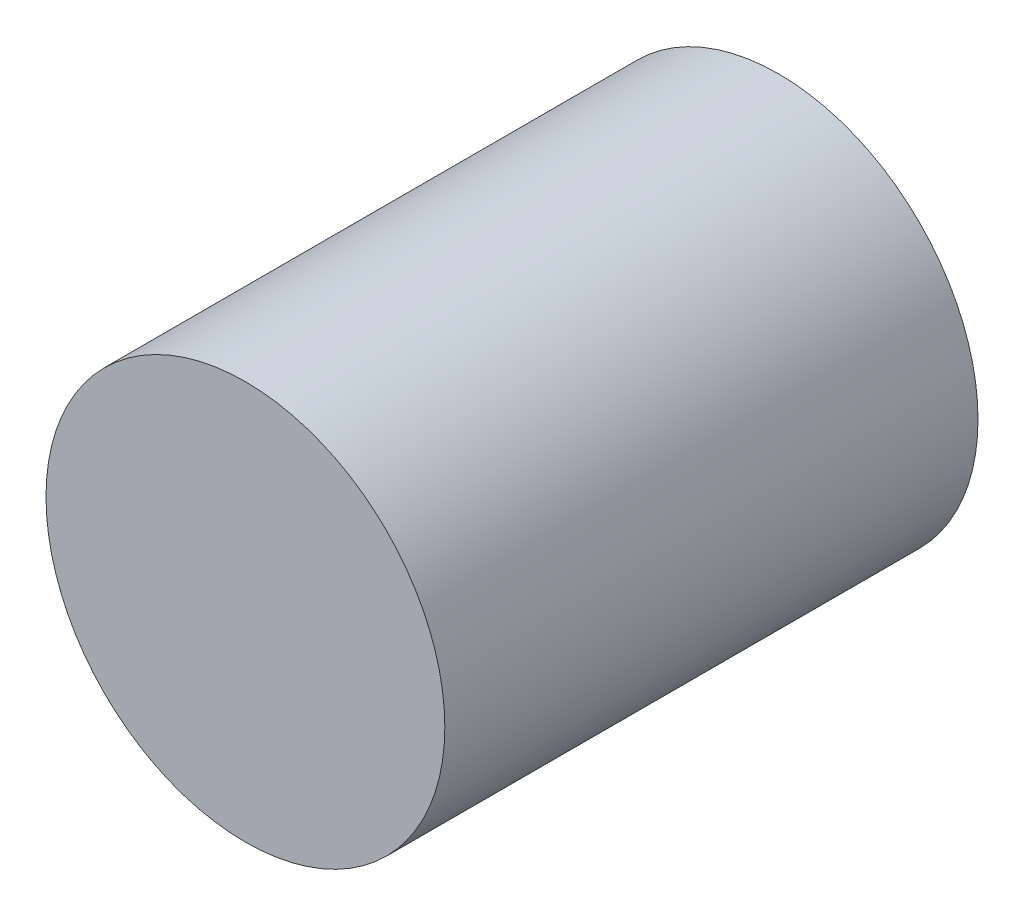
ISO-10303-21;
HEADER;
FILE_DESCRIPTION(('STEP AP214'),'2;1');
FILE_NAME('part.step','',(''),(''),'','','');
FILE_SCHEMA(('AUTOMOTIVE_DESIGN { 1 0 10303 214 1 1 1 1 }'));
ENDSEC;
DATA;
#1=APPLICATION_CONTEXT('core data for automotive mechanical design processes');
#2=APPLICATION_PROTOCOL_DEFINITION('international standard','automotive_design',2000,#1);
#3=PRODUCT_CONTEXT('',#1,'mechanical');
#4=PRODUCT('Part','Part','',(#3));
#5=PRODUCT_RELATED_PRODUCT_CATEGORY('part','',(#4));
#6=PRODUCT_DEFINITION_FORMATION('','',#4);
#7=PRODUCT_DEFINITION_CONTEXT('part definition',#1,'design');
#8=PRODUCT_DEFINITION('design','',#6,#7);
#9=PRODUCT_DEFINITION_SHAPE('','',#8);
#10=(LENGTH_UNIT() NAMED_UNIT(*) SI_UNIT(.MILLI.,.METRE.));
#11=(NAMED_UNIT(*) PLANE_ANGLE_UNIT() SI_UNIT($,.RADIAN.));
#12=(NAMED_UNIT(*) SI_UNIT($,.STERADIAN.) SOLID_ANGLE_UNIT());
#13=UNCERTAINTY_MEASURE_WITH_UNIT(LENGTH_MEASURE(1.E-05),#10,'distance_accuracy_value','');
#14=(GEOMETRIC_REPRESENTATION_CONTEXT(3) GLOBAL_UNCERTAINTY_ASSIGNED_CONTEXT((#13)) GLOBAL_UNIT_ASSIGNED_CONTEXT((#10,
#11,#12)) REPRESENTATION_CONTEXT('',''));
#15=CARTESIAN_POINT('',(0.,0.,0.));
#16=DIRECTION('',(0.,0.,1.));
#17=DIRECTION('',(1.,0.,0.));
#18=AXIS2_PLACEMENT_3D('',#15,#16,#17);
#19=CARTESIAN_POINT('',(0.,0.,12.7));
#20=DIRECTION('',(0.,0.,-1.));
#21=DIRECTION('',(-1.,0.,0.));
#22=AXIS2_PLACEMENT_3D('',#19,#20,#21);
#23=CYLINDRICAL_SURFACE('',#22,4.75);
#24=CARTESIAN_POINT('',(0.,0.,12.7));
#25=DIRECTION('',(0.,0.,1.));
#26=DIRECTION('',(1.,0.,0.));
#27=AXIS2_PLACEMENT_3D('',#24,#25,#26);
#28=CIRCLE('',#27,4.75);
#29=CARTESIAN_POINT('',(4.75,0.,12.7));
#30=VERTEX_POINT('',#29);
#31=EDGE_CURVE('E10',#30,#30,#28,.T.);
#32=ORIENTED_EDGE('',*,*,#31,.F.);
#33=EDGE_LOOP('',(#32));
#34=FACE_BOUND('',#33,.T.);
#35=CARTESIAN_POINT('',(0.,0.,0.));
#36=DIRECTION('',(0.,0.,1.));
#37=DIRECTION('',(1.,0.,0.));
#38=AXIS2_PLACEMENT_3D('',#35,#36,#37);
#39=CIRCLE('',#38,4.75);
#40=CARTESIAN_POINT('',(4.75,0.,0.));
#41=VERTEX_POINT('',#40);
#42=EDGE_CURVE('E33',#41,#41,#39,.T.);
#43=ORIENTED_EDGE('',*,*,#42,.T.);
#44=EDGE_LOOP('',(#43));
#45=FACE_BOUND('',#44,.T.);
#46=ADVANCED_FACE('F30',(#34,#45),#23,.T.);
#47=CARTESIAN_POINT('',(0.,0.,12.7));
#48=DIRECTION('',(0.,0.,1.));
#49=DIRECTION('',(1.,0.,0.));
#50=AXIS2_PLACEMENT_3D('',#47,#48,#49);
#51=PLANE('',#50);
#52=ORIENTED_EDGE('',*,*,#31,.T.);
#53=EDGE_LOOP('',(#52));
#54=FACE_BOUND('',#53,.T.);
#55=ADVANCED_FACE('F45',(#54),#51,.T.);
#56=CARTESIAN_POINT('',(0.,0.,0.));
#57=DIRECTION('',(0.,0.,1.));
#58=DIRECTION('',(1.,0.,0.));
#59=AXIS2_PLACEMENT_3D('',#56,#57,#58);
#60=PLANE('',#59);
#61=ORIENTED_EDGE('',*,*,#42,.F.);
#62=EDGE_LOOP('',(#61));
#63=FACE_BOUND('',#62,.T.);
#64=ADVANCED_FACE('F43',(#63),#60,.F.);
#65=CLOSED_SHELL('',(#46,#55,#64));
#66=MANIFOLD_SOLID_BREP('B2',#65);
#67=ADVANCED_BREP_SHAPE_REPRESENTATION('',(#18,#66),#14);
#68=SHAPE_DEFINITION_REPRESENTATION(#9,#67);
ENDSEC;
END-ISO-10303-21;
